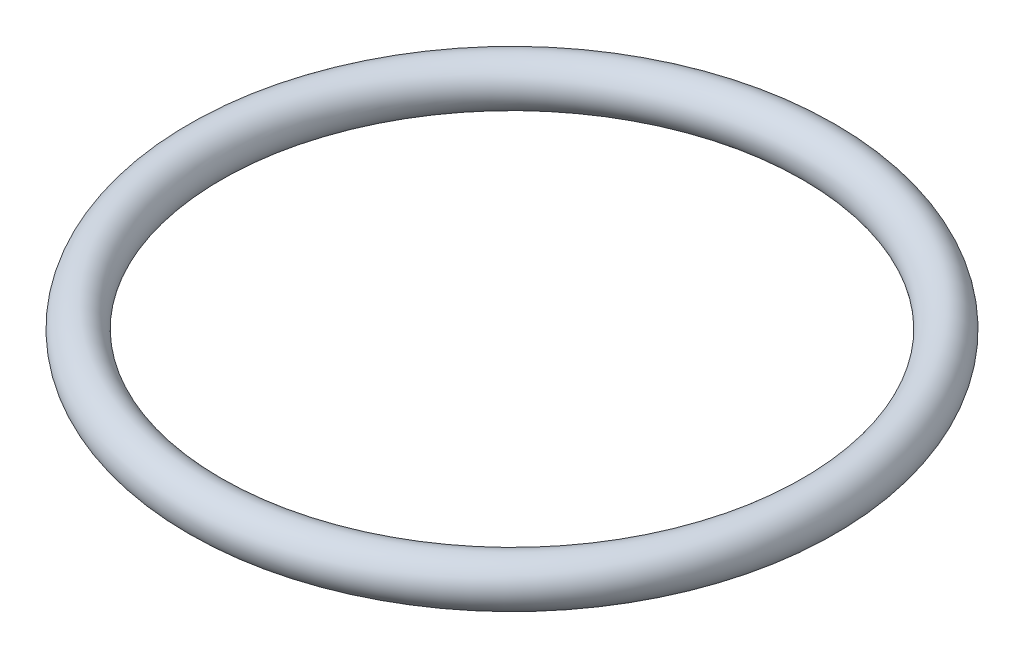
ISO-10303-21;
HEADER;
FILE_DESCRIPTION(('STEP AP214'),'2;1');
FILE_NAME('part.step','',(''),(''),'','','');
FILE_SCHEMA(('AUTOMOTIVE_DESIGN { 1 0 10303 214 1 1 1 1 }'));
ENDSEC;
DATA;
#1=APPLICATION_CONTEXT('core data for automotive mechanical design processes');
#2=APPLICATION_PROTOCOL_DEFINITION('international standard','automotive_design',2000,#1);
#3=PRODUCT_CONTEXT('',#1,'mechanical');
#4=PRODUCT('Part','Part','',(#3));
#5=PRODUCT_RELATED_PRODUCT_CATEGORY('part','',(#4));
#6=PRODUCT_DEFINITION_FORMATION('','',#4);
#7=PRODUCT_DEFINITION_CONTEXT('part definition',#1,'design');
#8=PRODUCT_DEFINITION('design','',#6,#7);
#9=PRODUCT_DEFINITION_SHAPE('','',#8);
#10=(LENGTH_UNIT() NAMED_UNIT(*) SI_UNIT(.MILLI.,.METRE.));
#11=(NAMED_UNIT(*) PLANE_ANGLE_UNIT() SI_UNIT($,.RADIAN.));
#12=(NAMED_UNIT(*) SI_UNIT($,.STERADIAN.) SOLID_ANGLE_UNIT());
#13=UNCERTAINTY_MEASURE_WITH_UNIT(LENGTH_MEASURE(1.E-05),#10,'distance_accuracy_value','');
#14=(GEOMETRIC_REPRESENTATION_CONTEXT(3) GLOBAL_UNCERTAINTY_ASSIGNED_CONTEXT((#13)) GLOBAL_UNIT_ASSIGNED_CONTEXT((#10,
#11,#12)) REPRESENTATION_CONTEXT('',''));
#15=CARTESIAN_POINT('',(0.,0.,0.));
#16=DIRECTION('',(0.,0.,1.));
#17=DIRECTION('',(1.,0.,0.));
#18=AXIS2_PLACEMENT_3D('',#15,#16,#17);
#19=CARTESIAN_POINT('',(0.,0.,0.));
#20=DIRECTION('',(0.,-1.,0.));
#21=DIRECTION('',(0.,0.,-1.));
#22=AXIS2_PLACEMENT_3D('',#19,#20,#21);
#23=TOROIDAL_SURFACE('',#22,12.0015,0.889);
#24=CARTESIAN_POINT('',(0.,0.,-12.8905));
#25=VERTEX_POINT('',#24);
#26=VERTEX_LOOP('',#25);
#27=FACE_BOUND('',#26,.T.);
#28=ADVANCED_FACE('F26',(#27),#23,.T.);
#29=CLOSED_SHELL('',(#28));
#30=MANIFOLD_SOLID_BREP('B2',#29);
#31=ADVANCED_BREP_SHAPE_REPRESENTATION('',(#18,#30),#14);
#32=SHAPE_DEFINITION_REPRESENTATION(#9,#31);
ENDSEC;
END-ISO-10303-21;
